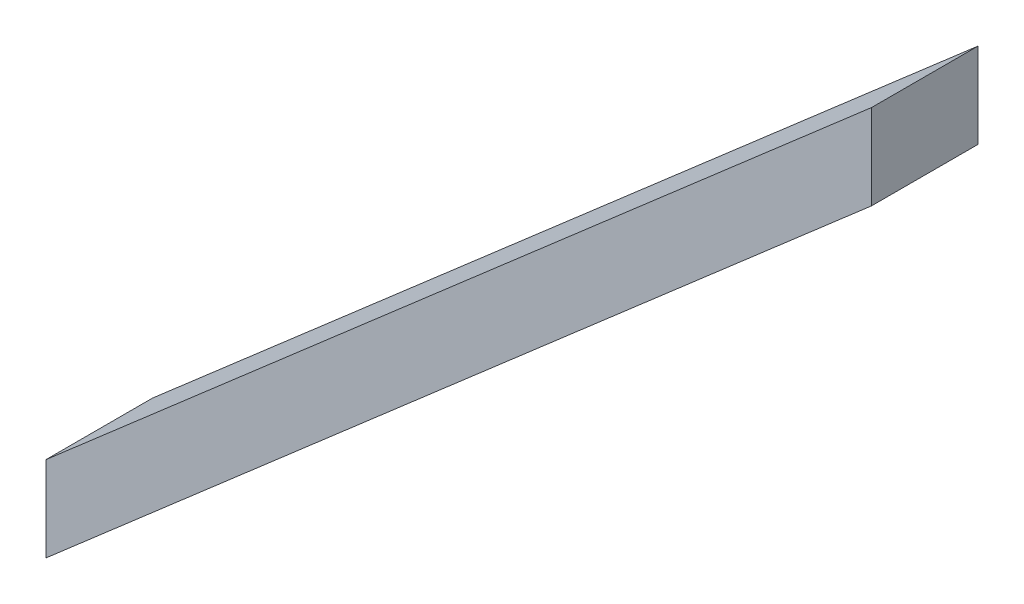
from build123d import *

# Parameters (mm, degrees)
BOSS_EXTRUDE1_DEPTH = 63


with BuildPart() as part:
    # Sketch1 → Boss-Extrude1 (new body)
    with BuildSketch(Plane.XY):
        Polygon((0, 0), (0, 50.350493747), (488, 474.562421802), (488, 424.211928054), align=None)
    extrude(amount=BOSS_EXTRUDE1_DEPTH)


solid = part.part
